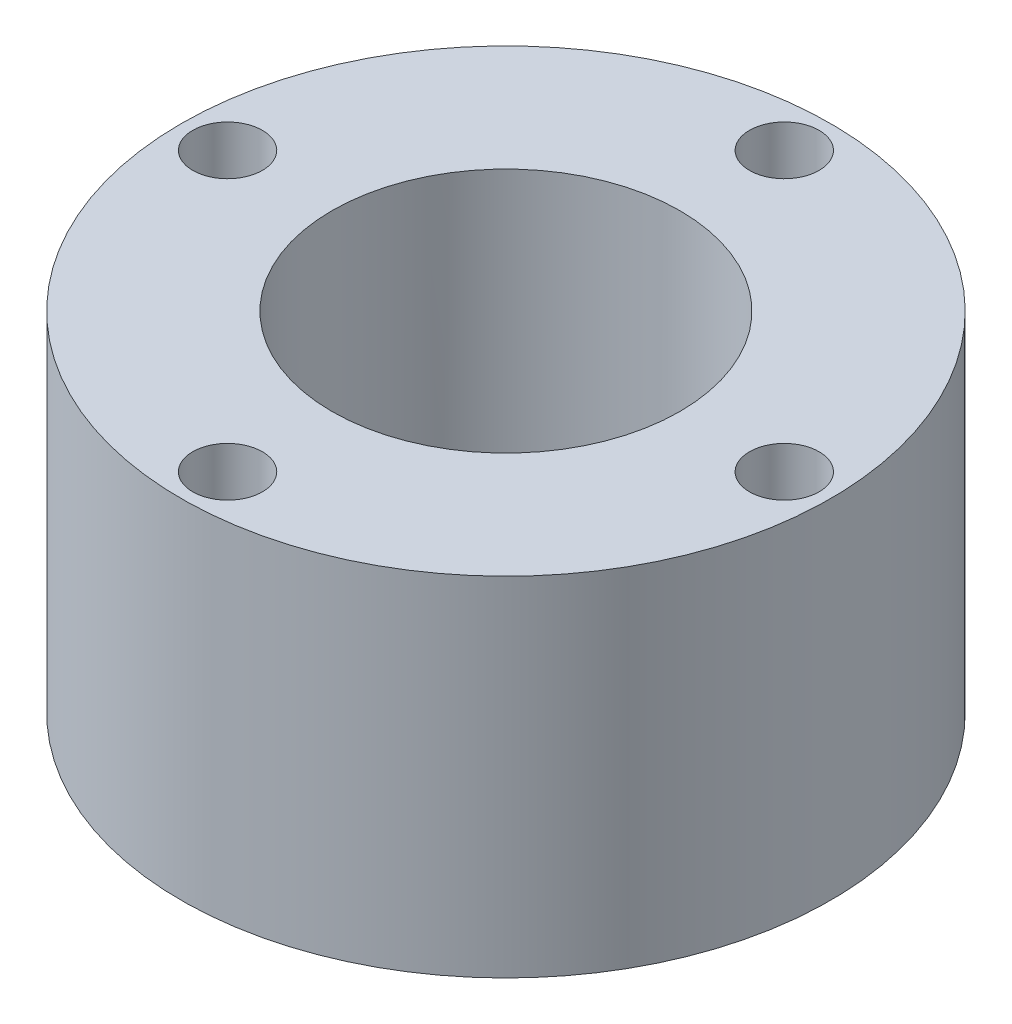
from build123d import *

# Parameters (mm, degrees)
SKETCH1_W          = 14
SKETCH1_H          = 120
SKETCH2_R          = 7.5
CUT_EXTRUDE1_DEPTH = 15.8
SKETCH4_R          = 10
CUT_EXTRUDE2_DEPTH = 9
SKETCH5_R          = 14
CUT_EXTRUDE3_DEPTH = 105
SKETCH6_R          = 1.5
CUT_EXTRUDE4_DEPTH = 3.5


with BuildPart() as part:
    # Sketch1 → Revolve1 (revolve)
    with BuildSketch(Plane.XY, mode=Mode.PRIVATE) as revolve1_sk:
        with Locations((7, 60)):
            Rectangle(SKETCH1_W, SKETCH1_H)
    revolve(revolve1_sk.sketch.rotate(Axis((0, 120, 0), (0, -1, 0)), 180), axis=Axis((0, 120, 0), (0, -1, 0)))

    # Sketch2 → Cut-Extrude1 (cut)
    with BuildSketch(Plane.XZ):
        Circle(SKETCH2_R)
    extrude(amount=-CUT_EXTRUDE1_DEPTH, mode=Mode.SUBTRACT)

    # Sketch4 → Cut-Extrude2 (cut)
    with BuildSketch(Plane.XZ.offset(-15.8)):
        Circle(SKETCH4_R)
    extrude(amount=-CUT_EXTRUDE2_DEPTH, mode=Mode.SUBTRACT)

    # Sketch5 → Cut-Extrude3 (cut)
    with BuildSketch(Plane(origin=(0, 120, 0), x_dir=(1, 0, 0), z_dir=(0, 1, 0))):
        with Locations(Location((0, 0, 0), (0, 0, 180))):
            Circle(SKETCH5_R)
    extrude(amount=-CUT_EXTRUDE3_DEPTH, mode=Mode.SUBTRACT)

    # Sketch6 → Cut-Extrude4 (cut)
    with BuildSketch(Plane(origin=(0, 15, 0), x_dir=(1, 0, 0), z_dir=(0, 1, 0))):
        with Locations(Location((0, 12, 0), (0, 0, 180))):
            Circle(SKETCH6_R)
        with Locations(Location((12, 0, 0), (0, 0, 180))):
            Circle(SKETCH6_R)
        with Locations(Location((0, -12, 0), (0, 0, 180))):
            Circle(SKETCH6_R)
        with Locations(Location((-12, 0, 0), (0, 0, 180))):
            Circle(SKETCH6_R)
    extrude(amount=-CUT_EXTRUDE4_DEPTH, mode=Mode.SUBTRACT)


solid = part.part
